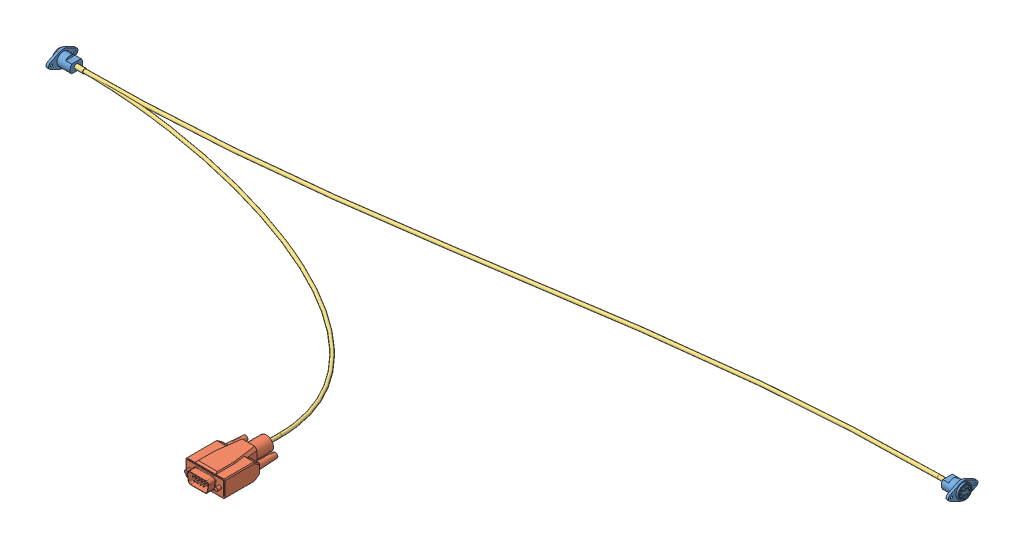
SolidWorks assembly Assem2.SLDASM, configuration Default (file format 13000). Lengths in mm.
Overall size (758.95 98.49 243.41).
4 component instances, 3 part files, 7 mates.
Components (placement in the parent):
- socket-6pinmindin-1: socket-6pinmindin.sldprt [Default] at (-563.964 -113.4819 -267.9635) x (0 0 1) z (-1 0 0) size (24.79 13.97 24.61)
- socket-6pinmindin-2: socket-6pinmindin.sldprt [Default] at (191.94 -49.9819 -267.9635) x (0 0 -1) z (1 0 0) size (24.79 13.97 24.61)
- db9 male-1: db9 male.sldprt [Default] at (-218.1356 -133.6128 -43.0625) x (-1 0 0) z (0 0 1) size (32.5 15.75 67.41)
- Cable^Assem2-1: Cable^Assem2.SLDPRT [Default] at origin size (729.74 86.59 175.49) (virtual)
Mates (geometry in assembly coordinates):
- Concentric11: concentric: cylinder of socket-6pinmindin-1 through (-565.488 -113.4819 -267.9635) axis (1 0 0) radius 5.9944; cylinder of ? through (194.988 -113.4819 -267.9635) axis (-1 0 0) radius 6.35
- Coincident11: coincident: plane of socket-6pinmindin-1 through (-563.964 -113.4819 -267.9635) normal (-1 0 0); plane of ? through (-563.964 -5.5319 -369.5635) normal (1 0 0)
- Concentric21: concentric: cylinder of socket-6pinmindin-2 through (193.464 -49.9819 -267.9635) axis (-1 0 0) radius 5.9944; cylinder of ? through (194.988 -49.9819 -267.9635) axis (-1 0 0) radius 6.35
- Coincident21: coincident: plane of socket-6pinmindin-2 through (191.94 -49.9819 -267.9635) normal (1 0 0); plane of ? through (191.94 -5.5319 -369.5635) normal (-1 0 0)
- Parallel11: parallel: plane of db9 male-1 through (-211.1356 -129.1928 -42.9475) normal (0 -1 0); plane of ? through (-224.2383 -129.5982 -42.9475) normal (0 1 0)
- Concentric31: concentric: cylinder of db9 male-1 through (-223.1356 -132.1128 -37.9475) axis (0 0 -1) radius 0.5; cylinder of ? through (-223.1356 -132.1128 -36.5975) axis (0 0 -1) radius 0.762
- Coincident31: coincident: plane of db9 male-1 through (-211.1356 -130.9428 -42.9475) normal (0 0 1); plane of ? through (-210.9586 -131.1222 -42.9475) normal (0 0 -1)
